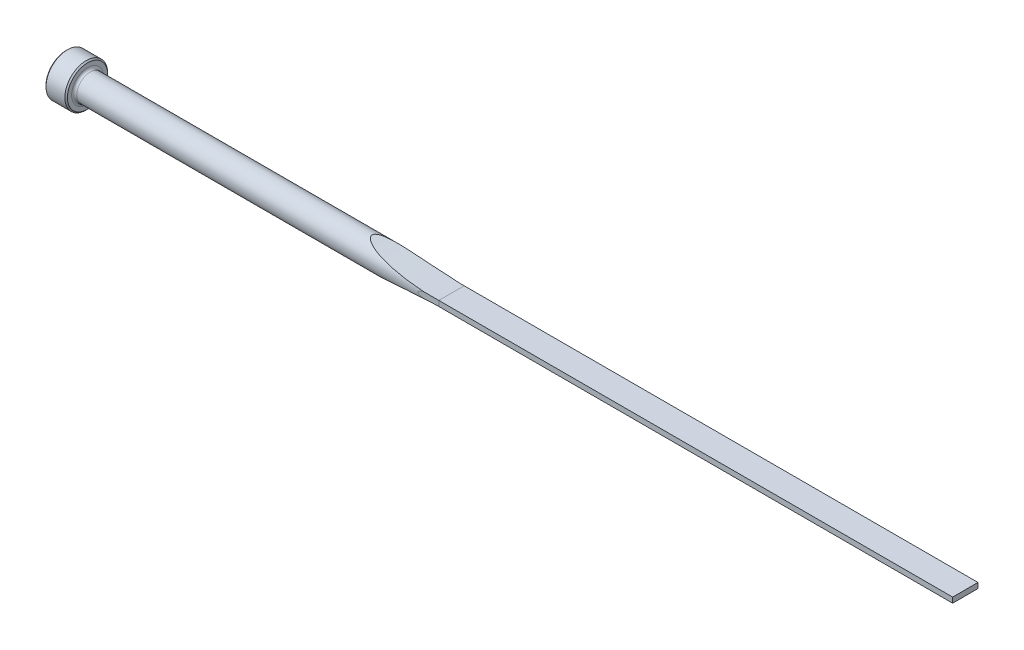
ISO-10303-21;
HEADER;
FILE_DESCRIPTION(('STEP AP214'),'2;1');
FILE_NAME('part.step','',(''),(''),'','','');
FILE_SCHEMA(('AUTOMOTIVE_DESIGN { 1 0 10303 214 1 1 1 1 }'));
ENDSEC;
DATA;
#1=APPLICATION_CONTEXT('core data for automotive mechanical design processes');
#2=APPLICATION_PROTOCOL_DEFINITION('international standard','automotive_design',2000,#1);
#3=PRODUCT_CONTEXT('',#1,'mechanical');
#4=PRODUCT('Part','Part','',(#3));
#5=PRODUCT_RELATED_PRODUCT_CATEGORY('part','',(#4));
#6=PRODUCT_DEFINITION_FORMATION('','',#4);
#7=PRODUCT_DEFINITION_CONTEXT('part definition',#1,'design');
#8=PRODUCT_DEFINITION('design','',#6,#7);
#9=PRODUCT_DEFINITION_SHAPE('','',#8);
#10=(LENGTH_UNIT() NAMED_UNIT(*) SI_UNIT(.MILLI.,.METRE.));
#11=(NAMED_UNIT(*) PLANE_ANGLE_UNIT() SI_UNIT($,.RADIAN.));
#12=(NAMED_UNIT(*) SI_UNIT($,.STERADIAN.) SOLID_ANGLE_UNIT());
#13=UNCERTAINTY_MEASURE_WITH_UNIT(LENGTH_MEASURE(1.E-05),#10,'distance_accuracy_value','');
#14=(GEOMETRIC_REPRESENTATION_CONTEXT(3) GLOBAL_UNCERTAINTY_ASSIGNED_CONTEXT((#13)) GLOBAL_UNIT_ASSIGNED_CONTEXT((#10,
#11,#12)) REPRESENTATION_CONTEXT('',''));
#15=CARTESIAN_POINT('',(0.,0.,0.));
#16=DIRECTION('',(0.,0.,1.));
#17=DIRECTION('',(1.,0.,0.));
#18=AXIS2_PLACEMENT_3D('',#15,#16,#17);
#19=CARTESIAN_POINT('',(0.,0.,0.));
#20=DIRECTION('',(-1.,0.,0.));
#21=DIRECTION('',(0.,0.,1.));
#22=AXIS2_PLACEMENT_3D('',#19,#20,#21);
#23=CYLINDRICAL_SURFACE('',#22,3.9624);
#24=CARTESIAN_POINT('',(7.112,0.,0.));
#25=DIRECTION('',(-1.,0.,0.));
#26=DIRECTION('',(0.,0.,1.));
#27=AXIS2_PLACEMENT_3D('',#24,#25,#26);
#28=CIRCLE('',#27,3.9624);
#29=CARTESIAN_POINT('',(7.112,0.,3.9624));
#30=VERTEX_POINT('',#29);
#31=EDGE_CURVE('E153',#30,#30,#28,.F.);
#32=ORIENTED_EDGE('',*,*,#31,.T.);
#33=EDGE_LOOP('',(#32));
#34=FACE_BOUND('',#33,.T.);
#35=CARTESIAN_POINT('',(114.3,1.25260892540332,3.75919999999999));
#36=CARTESIAN_POINT('',(114.00545970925,1.2524848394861,3.75919752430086));
#37=CARTESIAN_POINT('',(113.710891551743,1.24820563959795,3.76066368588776));
#38=CARTESIAN_POINT('',(113.12172376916,1.23049372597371,3.76652069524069));
#39=CARTESIAN_POINT('',(112.82712449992,1.21705045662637,3.77091491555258));
#40=CARTESIAN_POINT('',(112.230839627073,1.17967714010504,3.7827696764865));
#41=CARTESIAN_POINT('',(111.929172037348,1.15547987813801,3.79030802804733));
#42=CARTESIAN_POINT('',(111.327291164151,1.09440743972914,3.80840647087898));
#43=CARTESIAN_POINT('',(111.027077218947,1.05753871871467,3.81896502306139));
#44=CARTESIAN_POINT('',(110.580036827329,0.989457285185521,3.83693978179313));
#45=CARTESIAN_POINT('',(110.432172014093,0.964761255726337,3.84325719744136));
#46=CARTESIAN_POINT('',(110.137409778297,0.91004500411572,3.85658413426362));
#47=CARTESIAN_POINT('',(109.990512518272,0.880023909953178,3.86359376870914));
#48=CARTESIAN_POINT('',(109.69914126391,0.813153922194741,3.87821506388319));
#49=CARTESIAN_POINT('',(109.554658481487,0.776342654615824,3.88582328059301));
#50=CARTESIAN_POINT('',(109.268323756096,0.692871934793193,3.90159372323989));
#51=CARTESIAN_POINT('',(109.126472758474,0.646209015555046,3.90975614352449));
#52=CARTESIAN_POINT('',(108.918440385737,0.563595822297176,3.92220822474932));
#53=CARTESIAN_POINT('',(108.849788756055,0.533901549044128,3.92640002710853));
#54=CARTESIAN_POINT('',(108.715496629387,0.468472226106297,3.93475139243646));
#55=CARTESIAN_POINT('',(108.649847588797,0.432755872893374,3.93891101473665));
#56=CARTESIAN_POINT('',(108.560965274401,0.375177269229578,3.94463417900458));
#57=CARTESIAN_POINT('',(108.535194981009,0.357278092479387,3.94630548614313));
#58=CARTESIAN_POINT('',(108.485209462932,0.319212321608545,3.94956785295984));
#59=CARTESIAN_POINT('',(108.460999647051,0.299038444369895,3.95115862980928));
#60=CARTESIAN_POINT('',(108.414808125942,0.255565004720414,3.95421108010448));
#61=CARTESIAN_POINT('',(108.392865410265,0.23222299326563,3.9556704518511));
#62=CARTESIAN_POINT('',(108.353536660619,0.181966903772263,3.95829832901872));
#63=CARTESIAN_POINT('',(108.336121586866,0.155077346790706,3.95946868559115));
#64=CARTESIAN_POINT('',(108.315579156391,0.111677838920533,3.96085301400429));
#65=CARTESIAN_POINT('',(108.30962955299,0.0965229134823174,3.9612547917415));
#66=CARTESIAN_POINT('',(108.300234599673,0.0654488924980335,3.96188979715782));
#67=CARTESIAN_POINT('',(108.296786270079,0.0495307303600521,3.96212322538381));
#68=CARTESIAN_POINT('',(108.292762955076,0.0172237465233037,3.96239561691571));
#69=CARTESIAN_POINT('',(108.292205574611,0.00083265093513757,3.96243338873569));
#70=CARTESIAN_POINT('',(108.294083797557,-0.0317780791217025,3.9623061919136));
#71=CARTESIAN_POINT('',(108.296521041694,-0.0479976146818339,3.96214111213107));
#72=CARTESIAN_POINT('',(108.304634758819,-0.082037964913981,3.96159228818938));
#73=CARTESIAN_POINT('',(108.310722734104,-0.0997583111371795,3.96118077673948));
#74=CARTESIAN_POINT('',(108.325684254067,-0.13396962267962,3.96017177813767));
#75=CARTESIAN_POINT('',(108.334563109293,-0.15045816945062,3.959573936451));
#76=CARTESIAN_POINT('',(108.360406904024,-0.191779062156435,3.9578387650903));
#77=CARTESIAN_POINT('',(108.379002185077,-0.215572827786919,3.95659469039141));
#78=CARTESIAN_POINT('',(108.419379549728,-0.260234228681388,3.95390862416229));
#79=CARTESIAN_POINT('',(108.441170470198,-0.281093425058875,3.95246608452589));
#80=CARTESIAN_POINT('',(108.495492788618,-0.32804506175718,3.9488923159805));
#81=CARTESIAN_POINT('',(108.528933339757,-0.353067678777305,3.94670948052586));
#82=CARTESIAN_POINT('',(108.59803338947,-0.399868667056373,3.94224113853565));
#83=CARTESIAN_POINT('',(108.633697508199,-0.421639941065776,3.93995542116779));
#84=CARTESIAN_POINT('',(108.743097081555,-0.483498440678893,3.93301358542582));
#85=CARTESIAN_POINT('',(108.818906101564,-0.519877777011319,3.92829485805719));
#86=CARTESIAN_POINT('',(108.968751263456,-0.584557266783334,3.91916875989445));
#87=CARTESIAN_POINT('',(109.042649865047,-0.613195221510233,3.91475872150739));
#88=CARTESIAN_POINT('',(109.191901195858,-0.666460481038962,3.90604279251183));
#89=CARTESIAN_POINT('',(109.267254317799,-0.691086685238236,3.90173693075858));
#90=CARTESIAN_POINT('',(109.495036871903,-0.760533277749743,3.8890165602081));
#91=CARTESIAN_POINT('',(109.648854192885,-0.800789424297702,3.88081976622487));
#92=CARTESIAN_POINT('',(109.958806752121,-0.873378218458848,3.86512223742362));
#93=CARTESIAN_POINT('',(110.11494772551,-0.90568574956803,3.85762375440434));
#94=CARTESIAN_POINT('',(110.428180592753,-0.964193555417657,3.84341555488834));
#95=CARTESIAN_POINT('',(110.585270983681,-0.990401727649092,3.83670482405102));
#96=CARTESIAN_POINT('',(111.040465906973,-1.05927541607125,3.81847637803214));
#97=CARTESIAN_POINT('',(111.33953568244,-1.09580537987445,3.80800147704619));
#98=CARTESIAN_POINT('',(111.939246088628,-1.15634236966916,3.79004336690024));
#99=CARTESIAN_POINT('',(112.23988794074,-1.18033747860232,3.78256300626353));
#100=CARTESIAN_POINT('',(112.833875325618,-1.21737987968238,3.77080747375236));
#101=CARTESIAN_POINT('',(113.127202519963,-1.23070106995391,3.76645243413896));
#102=CARTESIAN_POINT('',(113.713695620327,-1.24824774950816,3.76064980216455));
#103=CARTESIAN_POINT('',(114.006861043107,-1.25248764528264,3.7591976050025));
#104=CARTESIAN_POINT('',(114.3,-1.25260892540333,3.75919999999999));
#105=B_SPLINE_CURVE_WITH_KNOTS('',3,(#35,#36,#37,#38,#39,#40,#41,#42,#43,#44,#45,#46,#47,#48,
#49,#50,#51,#52,#53,#54,#55,#56,#57,#58,#59,#60,#61,#62,#63,#64,#65,#66,#67,#68,#69,#70,#71,#72,
#73,#74,#75,#76,#77,#78,#79,#80,#81,#82,#83,#84,#85,#86,#87,#88,#89,#90,#91,#92,#93,#94,#95,#96,
#97,#98,#99,#100,#101,#102,#103,#104),.UNSPECIFIED.,.F.,.F.,(4,2,2,2,2,2,2,2,2,2,2,2,2,2,2,2,2,
2,2,2,2,2,2,2,2,2,2,2,2,2,2,2,2,2,4),(0.,0.883632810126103,1.76828515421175,2.67626818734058,
3.58378933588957,4.03386031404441,4.4840050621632,4.93172655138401,5.37960586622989,
5.60421216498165,5.82813356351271,5.92231486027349,6.01680676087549,6.11271989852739,
6.20800177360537,6.25668605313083,6.30531224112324,6.35423420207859,6.40318297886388,
6.45909548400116,6.51511503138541,6.60527273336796,6.69568462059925,6.82084462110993,
6.94627395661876,7.19837774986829,7.43639814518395,7.6744837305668,8.15173410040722,
8.63047368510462,9.10858990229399,10.0125950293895,10.9174580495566,11.7982831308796,
12.6777098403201),.UNSPECIFIED.);
#106=CARTESIAN_POINT('',(110.041058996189,0.889475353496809,3.86127535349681));
#107=VERTEX_POINT('',#106);
#108=CARTESIAN_POINT('',(110.041058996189,-0.889475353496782,3.86127535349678));
#109=VERTEX_POINT('',#108);
#110=EDGE_CURVE('E156',#107,#109,#105,.T.);
#111=ORIENTED_EDGE('',*,*,#110,.F.);
#112=CARTESIAN_POINT('',(114.3,0.787399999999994,3.88337675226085));
#113=CARTESIAN_POINT('',(113.969379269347,0.787400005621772,3.8833724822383));
#114=CARTESIAN_POINT('',(113.638761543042,0.789244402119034,3.88300338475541));
#115=CARTESIAN_POINT('',(112.977568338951,0.796621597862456,3.88149814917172));
#116=CARTESIAN_POINT('',(112.646992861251,0.802154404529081,3.88036200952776));
#117=CARTESIAN_POINT('',(111.655354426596,0.824285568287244,3.87574680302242));
#118=CARTESIAN_POINT('',(110.994411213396,0.846416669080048,3.87106094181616));
#119=CARTESIAN_POINT('',(109.673083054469,0.905424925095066,3.85768449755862));
#120=CARTESIAN_POINT('',(109.012698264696,0.942305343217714,3.84899302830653));
#121=CARTESIAN_POINT('',(107.693021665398,1.03078637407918,3.82625055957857));
#122=CARTESIAN_POINT('',(107.033729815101,1.08238642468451,3.81219976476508));
#123=CARTESIAN_POINT('',(105.918398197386,1.18220746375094,3.78216924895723));
#124=CARTESIAN_POINT('',(105.461963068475,1.22662148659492,3.76809892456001));
#125=CARTESIAN_POINT('',(104.54998563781,1.32248934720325,3.73553279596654));
#126=CARTESIAN_POINT('',(104.09444333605,1.37394318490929,3.71703699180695));
#127=CARTESIAN_POINT('',(103.184443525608,1.48386008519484,3.67454034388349));
#128=CARTESIAN_POINT('',(102.729986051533,1.54232336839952,3.65053932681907));
#129=CARTESIAN_POINT('',(101.822438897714,1.66620819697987,3.59568591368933));
#130=CARTESIAN_POINT('',(101.369349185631,1.73162957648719,3.56483368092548));
#131=CARTESIAN_POINT('',(100.464193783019,1.86946141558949,3.49452880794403));
#132=CARTESIAN_POINT('',(100.012130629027,1.94188215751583,3.45506340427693));
#133=CARTESIAN_POINT('',(99.1102314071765,2.09350738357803,3.36535346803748));
#134=CARTESIAN_POINT('',(98.6603952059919,2.1727114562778,3.3151095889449));
#135=CARTESIAN_POINT('',(97.7633080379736,2.33778135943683,3.20086383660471));
#136=CARTESIAN_POINT('',(97.3160591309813,2.42365187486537,3.13685223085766));
#137=CARTESIAN_POINT('',(96.6483923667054,2.55713953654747,3.02736328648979));
#138=CARTESIAN_POINT('',(96.4263945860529,2.60241068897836,2.98862653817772));
#139=CARTESIAN_POINT('',(95.9836897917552,2.69444697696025,2.90592636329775));
#140=CARTESIAN_POINT('',(95.7629827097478,2.74121203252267,2.86196321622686));
#141=CARTESIAN_POINT('',(95.3226484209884,2.83625735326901,2.76780501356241));
#142=CARTESIAN_POINT('',(95.1030250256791,2.88454095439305,2.71759540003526));
#143=CARTESIAN_POINT('',(94.6658149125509,2.98238888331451,2.60984200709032));
#144=CARTESIAN_POINT('',(94.4482285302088,3.03195341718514,2.55229704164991));
#145=CARTESIAN_POINT('',(94.0164200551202,3.13201098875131,2.42846573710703));
#146=CARTESIAN_POINT('',(93.8021904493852,3.18250114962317,2.36220348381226));
#147=CARTESIAN_POINT('',(93.3776644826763,3.28419729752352,2.21865519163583));
#148=CARTESIAN_POINT('',(93.1673664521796,3.33540296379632,2.14137395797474));
#149=CARTESIAN_POINT('',(92.7913165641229,3.42839026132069,1.98826340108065));
#150=CARTESIAN_POINT('',(92.6245782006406,3.47014650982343,1.91485673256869));
#151=CARTESIAN_POINT('',(92.296165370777,3.55337685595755,1.75564392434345));
#152=CARTESIAN_POINT('',(92.1345093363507,3.59484957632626,1.66979784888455));
#153=CARTESIAN_POINT('',(91.8980542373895,3.65618699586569,1.52825559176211));
#154=CARTESIAN_POINT('',(91.8197845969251,3.67660870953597,1.47860504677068));
#155=CARTESIAN_POINT('',(91.666451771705,3.71683087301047,1.37437693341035));
#156=CARTESIAN_POINT('',(91.591387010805,3.7366316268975,1.31980182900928));
#157=CARTESIAN_POINT('',(91.4459337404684,3.77519312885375,1.20506330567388));
#158=CARTESIAN_POINT('',(91.3755245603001,3.79395840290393,1.14492789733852));
#159=CARTESIAN_POINT('',(91.2408444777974,3.8300171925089,1.01781369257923));
#160=CARTESIAN_POINT('',(91.1765637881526,3.84731304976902,0.950846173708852));
#161=CARTESIAN_POINT('',(91.0702529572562,3.87603024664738,0.824736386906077));
#162=CARTESIAN_POINT('',(91.026462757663,3.88790000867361,0.767197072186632));
#163=CARTESIAN_POINT('',(90.9461270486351,3.90973187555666,0.64680152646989));
#164=CARTESIAN_POINT('',(90.909583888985,3.91969336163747,0.583943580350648));
#165=CARTESIAN_POINT('',(90.8459164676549,3.9370817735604,0.452174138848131));
#166=CARTESIAN_POINT('',(90.8189160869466,3.94447534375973,0.383196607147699));
#167=CARTESIAN_POINT('',(90.7780102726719,3.95568784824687,0.241204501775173));
#168=CARTESIAN_POINT('',(90.7640756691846,3.95951474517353,0.168199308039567));
#169=CARTESIAN_POINT('',(90.75186202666,3.9628688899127,0.0276036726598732));
#170=CARTESIAN_POINT('',(90.7522506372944,3.962762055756,-0.0398608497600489));
#171=CARTESIAN_POINT('',(90.7653488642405,3.95916522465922,-0.173500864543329));
#172=CARTESIAN_POINT('',(90.7780681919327,3.95567256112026,-0.239675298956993));
#173=CARTESIAN_POINT('',(90.8165826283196,3.94511439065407,-0.376839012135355));
#174=CARTESIAN_POINT('',(90.8438257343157,3.93765350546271,-0.447381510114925));
#175=CARTESIAN_POINT('',(90.9089002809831,3.91987937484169,-0.582973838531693));
#176=CARTESIAN_POINT('',(90.9467503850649,3.90956110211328,-0.648013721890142));
#177=CARTESIAN_POINT('',(91.0560500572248,3.87986173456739,-0.811067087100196));
#178=CARTESIAN_POINT('',(91.1337788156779,3.85882884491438,-0.904512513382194));
#179=CARTESIAN_POINT('',(91.3013669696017,3.8137689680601,-1.07884269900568));
#180=CARTESIAN_POINT('',(91.3912602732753,3.789733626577,-1.15969093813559));
#181=CARTESIAN_POINT('',(91.6088802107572,3.7319495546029,-1.33578715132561));
#182=CARTESIAN_POINT('',(91.7394534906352,3.69756955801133,-1.42726069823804));
#183=CARTESIAN_POINT('',(92.0085826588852,3.62740818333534,-1.59716585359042));
#184=CARTESIAN_POINT('',(92.1471538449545,3.59162416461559,-1.67557127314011));
#185=CARTESIAN_POINT('',(92.4301031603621,3.51931398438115,-1.8225730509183));
#186=CARTESIAN_POINT('',(92.5745073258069,3.48278496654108,-1.89111728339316));
#187=CARTESIAN_POINT('',(92.8667172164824,3.40966781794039,-2.01996308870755));
#188=CARTESIAN_POINT('',(93.0145196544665,3.37307977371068,-2.08027226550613));
#189=CARTESIAN_POINT('',(93.2916680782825,3.30524107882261,-2.18617581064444));
#190=CARTESIAN_POINT('',(93.420676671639,3.27396553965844,-2.23264583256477));
#191=CARTESIAN_POINT('',(93.6802039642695,3.21167027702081,-2.32136153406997));
#192=CARTESIAN_POINT('',(93.8107227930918,3.18065057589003,-2.36360684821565));
#193=CARTESIAN_POINT('',(94.2042032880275,3.08808399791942,-2.4849041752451));
#194=CARTESIAN_POINT('',(94.4689796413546,3.02705643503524,-2.5584770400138));
#195=CARTESIAN_POINT('',(95.0023238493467,2.90673022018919,-2.69439177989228));
#196=CARTESIAN_POINT('',(95.2708983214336,2.84743533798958,-2.75671050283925));
#197=CARTESIAN_POINT('',(95.8104857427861,2.73095083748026,-2.87214930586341));
#198=CARTESIAN_POINT('',(96.0814989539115,2.67376144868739,-2.9252683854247));
#199=CARTESIAN_POINT('',(96.6258098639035,2.56156938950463,-3.02399762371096));
#200=CARTESIAN_POINT('',(96.8991106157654,2.50657051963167,-3.069595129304));
#201=CARTESIAN_POINT('',(97.4471765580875,2.39896812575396,-3.15440243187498));
#202=CARTESIAN_POINT('',(97.7219418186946,2.34636471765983,-3.19361191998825));
#203=CARTESIAN_POINT('',(98.2723044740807,2.24369674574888,-3.26655764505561));
#204=CARTESIAN_POINT('',(98.5479004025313,2.19362909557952,-3.3003006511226));
#205=CARTESIAN_POINT('',(99.1000682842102,2.09601517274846,-3.36313743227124));
#206=CARTESIAN_POINT('',(99.3766402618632,2.04846896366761,-3.39223109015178));
#207=CARTESIAN_POINT('',(100.22528730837,1.90671704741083,-3.47524875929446));
#208=CARTESIAN_POINT('',(100.798704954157,1.81668630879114,-3.52265966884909));
#209=CARTESIAN_POINT('',(101.948100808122,1.64776053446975,-3.60475663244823));
#210=CARTESIAN_POINT('',(102.524079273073,1.5688666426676,-3.63944137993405));
#211=CARTESIAN_POINT('',(103.678386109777,1.4222877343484,-3.69918591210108));
#212=CARTESIAN_POINT('',(104.256715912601,1.35461111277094,-3.72423850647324));
#213=CARTESIAN_POINT('',(105.414829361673,1.2306145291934,-3.76702730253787));
#214=CARTESIAN_POINT('',(105.99461295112,1.17429413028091,-3.78476378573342));
#215=CARTESIAN_POINT('',(107.154045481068,1.07316172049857,-3.81467022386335));
#216=CARTESIAN_POINT('',(107.733691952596,1.02832485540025,-3.82685224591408));
#217=CARTESIAN_POINT('',(108.893833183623,0.950026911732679,-3.84703720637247));
#218=CARTESIAN_POINT('',(109.474327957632,0.916566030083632,-3.85504007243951));
#219=CARTESIAN_POINT('',(110.635679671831,0.861049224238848,-3.86781814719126));
#220=CARTESIAN_POINT('',(111.216536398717,0.838989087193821,-3.872594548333));
#221=CARTESIAN_POINT('',(112.378569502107,0.806266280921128,-3.87953998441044));
#222=CARTESIAN_POINT('',(112.959745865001,0.795603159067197,-3.8817091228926));
#223=CARTESIAN_POINT('',(113.667465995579,0.789560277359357,-3.88293796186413));
#224=CARTESIAN_POINT('',(113.79397377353,0.788750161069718,-3.88310266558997));
#225=CARTESIAN_POINT('',(114.046987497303,0.787670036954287,-3.88332214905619));
#226=CARTESIAN_POINT('',(114.173493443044,0.787400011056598,-3.88337693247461));
#227=CARTESIAN_POINT('',(114.3,0.7874,-3.88337675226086));
#228=B_SPLINE_CURVE_WITH_KNOTS('',3,(#112,#113,#114,#115,#116,#117,#118,#119,#120,#121,#122,
#123,#124,#125,#126,#127,#128,#129,#130,#131,#132,#133,#134,#135,#136,#137,#138,#139,#140,#141,
#142,#143,#144,#145,#146,#147,#148,#149,#150,#151,#152,#153,#154,#155,#156,#157,#158,#159,#160,
#161,#162,#163,#164,#165,#166,#167,#168,#169,#170,#171,#172,#173,#174,#175,#176,#177,#178,#179,
#180,#181,#182,#183,#184,#185,#186,#187,#188,#189,#190,#191,#192,#193,#194,#195,#196,#197,#198,
#199,#200,#201,#202,#203,#204,#205,#206,#207,#208,#209,#210,#211,#212,#213,#214,#215,#216,#217,
#218,#219,#220,#221,#222,#223,#224,#225,#226,#227),.UNSPECIFIED.,.F.,.F.,(4,2,2,2,2,2,2,2,2,2,2,
2,2,2,2,2,2,2,2,2,2,2,2,2,2,2,2,2,2,2,2,2,2,2,2,2,2,2,2,2,2,2,2,2,2,2,2,2,2,2,2,2,2,2,2,2,2,4),
(0.,0.991850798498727,1.98370359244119,3.96750439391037,5.95174430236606,7.93590844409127,
9.31226185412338,10.6886152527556,12.0650119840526,13.4413759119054,14.8197934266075,
16.1981273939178,17.5774389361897,18.2669484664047,18.9564211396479,19.6475318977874,
20.3387545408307,21.0281059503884,21.7171576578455,22.2775648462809,22.8398127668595,
23.1244115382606,23.4088686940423,23.6919637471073,23.9745988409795,24.1939791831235,
24.413430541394,24.6356342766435,24.8573407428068,25.0584810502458,25.2597798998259,
25.4864909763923,25.7136034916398,26.0815750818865,26.4505943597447,26.9387163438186,
27.4278050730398,27.9193909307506,28.4105197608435,28.8323721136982,29.2542609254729,
30.0983968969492,30.944250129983,31.7901952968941,32.637549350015,33.4849443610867,
34.3312818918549,35.1776407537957,36.9244292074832,38.671396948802,40.4196662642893,
42.1678683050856,43.9122540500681,45.656669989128,47.4004408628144,49.1441424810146,
49.5236733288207,49.9031914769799),.UNSPECIFIED.);
#229=CARTESIAN_POINT('',(110.041058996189,0.88947535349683,-3.8612753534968));
#230=VERTEX_POINT('',#229);
#231=EDGE_CURVE('E106',#107,#230,#228,.T.);
#232=ORIENTED_EDGE('',*,*,#231,.T.);
#233=CARTESIAN_POINT('',(114.3,1.25260892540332,-3.75919999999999));
#234=CARTESIAN_POINT('',(114.00545970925,1.2524848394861,-3.75919752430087));
#235=CARTESIAN_POINT('',(113.710891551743,1.24820563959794,-3.76066368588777));
#236=CARTESIAN_POINT('',(113.12172376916,1.23049372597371,-3.76652069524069));
#237=CARTESIAN_POINT('',(112.827124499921,1.21705045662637,-3.77091491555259));
#238=CARTESIAN_POINT('',(112.230839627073,1.17967714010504,-3.78276967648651));
#239=CARTESIAN_POINT('',(111.929172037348,1.15547987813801,-3.79030802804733));
#240=CARTESIAN_POINT('',(111.327291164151,1.09440743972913,-3.80840647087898));
#241=CARTESIAN_POINT('',(111.027077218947,1.05753871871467,-3.81896502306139));
#242=CARTESIAN_POINT('',(110.580036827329,0.98945728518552,-3.83693978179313));
#243=CARTESIAN_POINT('',(110.432172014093,0.964761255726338,-3.84325719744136));
#244=CARTESIAN_POINT('',(110.137409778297,0.910045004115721,-3.85658413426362));
#245=CARTESIAN_POINT('',(109.990512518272,0.880023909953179,-3.86359376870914));
#246=CARTESIAN_POINT('',(109.69914126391,0.813153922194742,-3.87821506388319));
#247=CARTESIAN_POINT('',(109.554658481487,0.776342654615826,-3.88582328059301));
#248=CARTESIAN_POINT('',(109.268323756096,0.692871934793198,-3.90159372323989));
#249=CARTESIAN_POINT('',(109.126472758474,0.646209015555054,-3.90975614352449));
#250=CARTESIAN_POINT('',(108.918440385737,0.56359582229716,-3.92220822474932));
#251=CARTESIAN_POINT('',(108.849788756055,0.533901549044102,-3.92640002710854));
#252=CARTESIAN_POINT('',(108.715496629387,0.468472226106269,-3.93475139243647));
#253=CARTESIAN_POINT('',(108.649847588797,0.432755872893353,-3.93891101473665));
#254=CARTESIAN_POINT('',(108.560965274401,0.37517726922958,-3.94463417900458));
#255=CARTESIAN_POINT('',(108.535194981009,0.357278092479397,-3.94630548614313));
#256=CARTESIAN_POINT('',(108.485209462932,0.319212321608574,-3.94956785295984));
#257=CARTESIAN_POINT('',(108.460999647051,0.299038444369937,-3.95115862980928));
#258=CARTESIAN_POINT('',(108.414808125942,0.25556500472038,-3.95421108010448));
#259=CARTESIAN_POINT('',(108.392865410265,0.232222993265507,-3.95567045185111));
#260=CARTESIAN_POINT('',(108.353536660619,0.181966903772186,-3.95829832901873));
#261=CARTESIAN_POINT('',(108.336121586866,0.15507734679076,-3.95946868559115));
#262=CARTESIAN_POINT('',(108.315579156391,0.111677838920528,-3.96085301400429));
#263=CARTESIAN_POINT('',(108.30962955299,0.0965229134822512,-3.9612547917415));
#264=CARTESIAN_POINT('',(108.300234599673,0.0654488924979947,-3.96188979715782));
#265=CARTESIAN_POINT('',(108.296786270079,0.0495307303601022,-3.96212322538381));
#266=CARTESIAN_POINT('',(108.292762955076,0.0172237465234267,-3.9623956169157));
#267=CARTESIAN_POINT('',(108.292205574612,0.000832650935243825,-3.96243338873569));
#268=CARTESIAN_POINT('',(108.294083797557,-0.0317780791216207,-3.9623061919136));
#269=CARTESIAN_POINT('',(108.296521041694,-0.0479976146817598,-3.96214111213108));
#270=CARTESIAN_POINT('',(108.304634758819,-0.0820379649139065,-3.96159228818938));
#271=CARTESIAN_POINT('',(108.310722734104,-0.0997583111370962,-3.96118077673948));
#272=CARTESIAN_POINT('',(108.325684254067,-0.133969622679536,-3.96017177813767));
#273=CARTESIAN_POINT('',(108.334563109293,-0.150458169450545,-3.959573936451));
#274=CARTESIAN_POINT('',(108.360406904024,-0.191779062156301,-3.9578387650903));
#275=CARTESIAN_POINT('',(108.379002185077,-0.215572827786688,-3.95659469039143));
#276=CARTESIAN_POINT('',(108.419379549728,-0.260234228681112,-3.9539086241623));
#277=CARTESIAN_POINT('',(108.441170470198,-0.281093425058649,-3.9524660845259));
#278=CARTESIAN_POINT('',(108.495492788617,-0.328045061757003,-3.94889231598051));
#279=CARTESIAN_POINT('',(108.528933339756,-0.353067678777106,-3.94670948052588));
#280=CARTESIAN_POINT('',(108.59803338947,-0.399868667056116,-3.94224113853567));
#281=CARTESIAN_POINT('',(108.633697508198,-0.421639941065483,-3.93995542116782));
#282=CARTESIAN_POINT('',(108.743097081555,-0.483498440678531,-3.93301358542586));
#283=CARTESIAN_POINT('',(108.818906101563,-0.519877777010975,-3.92829485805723));
#284=CARTESIAN_POINT('',(108.968751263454,-0.584557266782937,-3.91916875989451));
#285=CARTESIAN_POINT('',(109.042649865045,-0.613195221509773,-3.91475872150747));
#286=CARTESIAN_POINT('',(109.191901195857,-0.666460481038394,-3.90604279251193));
#287=CARTESIAN_POINT('',(109.267254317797,-0.691086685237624,-3.90173693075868));
#288=CARTESIAN_POINT('',(109.495036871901,-0.760533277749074,-3.88901656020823));
#289=CARTESIAN_POINT('',(109.648854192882,-0.800789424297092,-3.88081976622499));
#290=CARTESIAN_POINT('',(109.958806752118,-0.873378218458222,-3.86512223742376));
#291=CARTESIAN_POINT('',(110.114947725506,-0.905685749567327,-3.8576237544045));
#292=CARTESIAN_POINT('',(110.42818059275,-0.964193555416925,-3.84341555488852));
#293=CARTESIAN_POINT('',(110.585270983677,-0.990401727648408,-3.8367048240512));
#294=CARTESIAN_POINT('',(111.040465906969,-1.05927541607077,-3.81847637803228));
#295=CARTESIAN_POINT('',(111.339535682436,-1.09580537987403,-3.80800147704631));
#296=CARTESIAN_POINT('',(111.939246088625,-1.1563423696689,-3.79004336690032));
#297=CARTESIAN_POINT('',(112.239887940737,-1.18033747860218,-3.78256300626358));
#298=CARTESIAN_POINT('',(112.833875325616,-1.21737987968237,-3.77080747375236));
#299=CARTESIAN_POINT('',(113.127202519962,-1.23070106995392,-3.76645243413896));
#300=CARTESIAN_POINT('',(113.713695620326,-1.24824774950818,-3.76064980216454));
#301=CARTESIAN_POINT('',(114.006861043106,-1.25248764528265,-3.7591976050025));
#302=CARTESIAN_POINT('',(114.3,-1.25260892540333,-3.75919999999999));
#303=B_SPLINE_CURVE_WITH_KNOTS('',3,(#233,#234,#235,#236,#237,#238,#239,#240,#241,#242,#243,
#244,#245,#246,#247,#248,#249,#250,#251,#252,#253,#254,#255,#256,#257,#258,#259,#260,#261,#262,
#263,#264,#265,#266,#267,#268,#269,#270,#271,#272,#273,#274,#275,#276,#277,#278,#279,#280,#281,
#282,#283,#284,#285,#286,#287,#288,#289,#290,#291,#292,#293,#294,#295,#296,#297,#298,#299,#300,
#301,#302),.UNSPECIFIED.,.F.,.F.,(4,2,2,2,2,2,2,2,2,2,2,2,2,2,2,2,2,2,2,2,2,2,2,2,2,2,2,2,2,2,2,
2,2,2,4),(0.,0.883632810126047,1.76828515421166,2.67626818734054,3.58378933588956,
4.03386031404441,4.48400506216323,4.93172655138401,5.37960586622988,5.60421216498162,
5.82813356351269,5.92231486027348,6.01680676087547,6.11271989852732,6.20800177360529,
6.25668605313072,6.30531224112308,6.35423420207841,6.40318297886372,6.459095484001,
6.51511503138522,6.60527273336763,6.69568462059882,6.82084462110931,6.94627395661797,
7.1983777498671,7.4363981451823,7.6744837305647,8.15173410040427,8.63047368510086,
9.10858990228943,10.0125950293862,10.9174580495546,11.7982831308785,12.67770984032),.UNSPECIFIED.);
#304=CARTESIAN_POINT('',(110.041058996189,-0.889475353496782,-3.86127535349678));
#305=VERTEX_POINT('',#304);
#306=EDGE_CURVE('E175',#230,#305,#303,.T.);
#307=ORIENTED_EDGE('',*,*,#306,.T.);
#308=CARTESIAN_POINT('',(114.3,-0.787399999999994,3.88337675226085));
#309=CARTESIAN_POINT('',(113.969379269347,-0.787400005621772,3.8833724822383));
#310=CARTESIAN_POINT('',(113.638761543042,-0.789244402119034,3.88300338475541));
#311=CARTESIAN_POINT('',(112.977568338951,-0.796621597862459,3.88149814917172));
#312=CARTESIAN_POINT('',(112.646992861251,-0.802154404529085,3.88036200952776));
#313=CARTESIAN_POINT('',(111.655354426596,-0.824285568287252,3.87574680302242));
#314=CARTESIAN_POINT('',(110.994411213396,-0.846416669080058,3.87106094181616));
#315=CARTESIAN_POINT('',(109.673083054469,-0.905424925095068,3.85768449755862));
#316=CARTESIAN_POINT('',(109.012698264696,-0.942305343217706,3.84899302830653));
#317=CARTESIAN_POINT('',(107.693021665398,-1.03078637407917,3.82625055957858));
#318=CARTESIAN_POINT('',(107.033729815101,-1.0823864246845,3.81219976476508));
#319=CARTESIAN_POINT('',(105.918398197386,-1.18220746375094,3.78216924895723));
#320=CARTESIAN_POINT('',(105.461963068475,-1.22662148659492,3.76809892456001));
#321=CARTESIAN_POINT('',(104.54998563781,-1.32248934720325,3.73553279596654));
#322=CARTESIAN_POINT('',(104.09444333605,-1.3739431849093,3.71703699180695));
#323=CARTESIAN_POINT('',(103.184443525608,-1.48386008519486,3.67454034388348));
#324=CARTESIAN_POINT('',(102.729986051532,-1.54232336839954,3.65053932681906));
#325=CARTESIAN_POINT('',(101.822438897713,-1.66620819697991,3.59568591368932));
#326=CARTESIAN_POINT('',(101.36934918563,-1.73162957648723,3.56483368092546));
#327=CARTESIAN_POINT('',(100.464193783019,-1.86946141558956,3.494528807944));
#328=CARTESIAN_POINT('',(100.012130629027,-1.9418821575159,3.45506340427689));
#329=CARTESIAN_POINT('',(99.1102314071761,-2.0935073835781,3.36535346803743));
#330=CARTESIAN_POINT('',(98.6603952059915,-2.17271145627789,3.31510958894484));
#331=CARTESIAN_POINT('',(97.7633080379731,-2.33778135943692,3.20086383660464));
#332=CARTESIAN_POINT('',(97.3160591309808,-2.42365187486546,3.1368522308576));
#333=CARTESIAN_POINT('',(96.6483923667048,-2.55713953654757,3.0273632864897));
#334=CARTESIAN_POINT('',(96.4263945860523,-2.60241068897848,2.98862653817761));
#335=CARTESIAN_POINT('',(95.9836897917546,-2.69444697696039,2.90592636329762));
#336=CARTESIAN_POINT('',(95.7629827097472,-2.7412120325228,2.86196321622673));
#337=CARTESIAN_POINT('',(95.3226484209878,-2.83625735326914,2.76780501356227));
#338=CARTESIAN_POINT('',(95.1030250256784,-2.88454095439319,2.71759540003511));
#339=CARTESIAN_POINT('',(94.6658149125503,-2.98238888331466,2.60984200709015));
#340=CARTESIAN_POINT('',(94.4482285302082,-3.03195341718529,2.55229704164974));
#341=CARTESIAN_POINT('',(94.0164200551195,-3.13201098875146,2.42846573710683));
#342=CARTESIAN_POINT('',(93.8021904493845,-3.18250114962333,2.36220348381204));
#343=CARTESIAN_POINT('',(93.3776644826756,-3.28419729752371,2.21865519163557));
#344=CARTESIAN_POINT('',(93.1673664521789,-3.33540296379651,2.14137395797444));
#345=CARTESIAN_POINT('',(92.7913165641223,-3.42839026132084,1.98826340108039));
#346=CARTESIAN_POINT('',(92.6245782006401,-3.47014650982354,1.9148567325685));
#347=CARTESIAN_POINT('',(92.2961653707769,-3.55337685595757,1.75564392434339));
#348=CARTESIAN_POINT('',(92.1345093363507,-3.59484957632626,1.66979784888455));
#349=CARTESIAN_POINT('',(91.8980542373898,-3.65618699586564,1.52825559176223));
#350=CARTESIAN_POINT('',(91.8197845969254,-3.6766087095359,1.47860504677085));
#351=CARTESIAN_POINT('',(91.6664517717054,-3.71683087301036,1.37437693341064));
#352=CARTESIAN_POINT('',(91.5913870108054,-3.73663162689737,1.31980182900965));
#353=CARTESIAN_POINT('',(91.445933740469,-3.77519312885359,1.20506330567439));
#354=CARTESIAN_POINT('',(91.3755245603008,-3.79395840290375,1.14492789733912));
#355=CARTESIAN_POINT('',(91.2408444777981,-3.8300171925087,1.01781369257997));
#356=CARTESIAN_POINT('',(91.1765637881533,-3.84731304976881,0.950846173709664));
#357=CARTESIAN_POINT('',(91.070252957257,-3.87603024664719,0.824736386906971));
#358=CARTESIAN_POINT('',(91.0264627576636,-3.88790000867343,0.767197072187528));
#359=CARTESIAN_POINT('',(90.9461270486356,-3.90973187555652,0.646801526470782));
#360=CARTESIAN_POINT('',(90.9095838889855,-3.91969336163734,0.583943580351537));
#361=CARTESIAN_POINT('',(90.8459164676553,-3.9370817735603,0.452174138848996));
#362=CARTESIAN_POINT('',(90.8189160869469,-3.94447534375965,0.383196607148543));
#363=CARTESIAN_POINT('',(90.7780102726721,-3.95568784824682,0.241204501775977));
#364=CARTESIAN_POINT('',(90.7640756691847,-3.9595147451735,0.168199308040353));
#365=CARTESIAN_POINT('',(90.75186202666,-3.9628688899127,0.0276036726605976));
#366=CARTESIAN_POINT('',(90.7522506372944,-3.96276205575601,-0.0398608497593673));
#367=CARTESIAN_POINT('',(90.7653488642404,-3.95916522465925,-0.173500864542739));
#368=CARTESIAN_POINT('',(90.7780681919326,-3.95567256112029,-0.239675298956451));
#369=CARTESIAN_POINT('',(90.8165826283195,-3.94511439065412,-0.37683901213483));
#370=CARTESIAN_POINT('',(90.8438257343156,-3.93765350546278,-0.447381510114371));
#371=CARTESIAN_POINT('',(90.9089002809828,-3.91987937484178,-0.582973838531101));
#372=CARTESIAN_POINT('',(90.9467503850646,-3.90956110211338,-0.648013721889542));
#373=CARTESIAN_POINT('',(91.0560500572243,-3.87986173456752,-0.811067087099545));
#374=CARTESIAN_POINT('',(91.1337788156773,-3.85882884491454,-0.904512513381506));
#375=CARTESIAN_POINT('',(91.3013669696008,-3.81376896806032,-1.07884269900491));
#376=CARTESIAN_POINT('',(91.3912602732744,-3.78973362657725,-1.15969093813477));
#377=CARTESIAN_POINT('',(91.6088802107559,-3.73194955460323,-1.33578715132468));
#378=CARTESIAN_POINT('',(91.7394534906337,-3.6975695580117,-1.42726069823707));
#379=CARTESIAN_POINT('',(92.0085826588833,-3.62740818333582,-1.59716585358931));
#380=CARTESIAN_POINT('',(92.1471538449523,-3.59162416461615,-1.67557127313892));
#381=CARTESIAN_POINT('',(92.4301031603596,-3.51931398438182,-1.82257305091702));
#382=CARTESIAN_POINT('',(92.5745073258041,-3.48278496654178,-1.89111728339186));
#383=CARTESIAN_POINT('',(92.8667172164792,-3.40966781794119,-2.01996308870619));
#384=CARTESIAN_POINT('',(93.0145196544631,-3.37307977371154,-2.08027226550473));
#385=CARTESIAN_POINT('',(93.2916680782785,-3.30524107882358,-2.18617581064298));
#386=CARTESIAN_POINT('',(93.4206766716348,-3.27396553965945,-2.23264583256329));
#387=CARTESIAN_POINT('',(93.6802039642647,-3.21167027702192,-2.32136153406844));
#388=CARTESIAN_POINT('',(93.8107227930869,-3.18065057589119,-2.36360684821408));
#389=CARTESIAN_POINT('',(94.2042032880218,-3.08808399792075,-2.48490417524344));
#390=CARTESIAN_POINT('',(94.4689796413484,-3.02705643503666,-2.55847704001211));
#391=CARTESIAN_POINT('',(95.0023238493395,-2.90673022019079,-2.69439177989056));
#392=CARTESIAN_POINT('',(95.2708983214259,-2.84743533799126,-2.75671050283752));
#393=CARTESIAN_POINT('',(95.8104857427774,-2.73095083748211,-2.87214930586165));
#394=CARTESIAN_POINT('',(96.0814989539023,-2.67376144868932,-2.92526838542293));
#395=CARTESIAN_POINT('',(96.6258098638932,-2.56156938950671,-3.02399762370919));
#396=CARTESIAN_POINT('',(96.8991106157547,-2.50657051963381,-3.06959512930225));
#397=CARTESIAN_POINT('',(97.4471765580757,-2.39896812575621,-3.15440243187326));
#398=CARTESIAN_POINT('',(97.7219418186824,-2.34636471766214,-3.19361191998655));
#399=CARTESIAN_POINT('',(98.2723044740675,-2.24369674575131,-3.26655764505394));
#400=CARTESIAN_POINT('',(98.5479004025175,-2.19362909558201,-3.30030065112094));
#401=CARTESIAN_POINT('',(99.1000682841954,-2.09601517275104,-3.36313743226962));
#402=CARTESIAN_POINT('',(99.376640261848,-2.04846896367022,-3.3922310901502));
#403=CARTESIAN_POINT('',(100.225287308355,-1.90671704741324,-3.47524875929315));
#404=CARTESIAN_POINT('',(100.798704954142,-1.81668630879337,-3.52265966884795));
#405=CARTESIAN_POINT('',(101.948100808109,-1.64776053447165,-3.60475663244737));
#406=CARTESIAN_POINT('',(102.52407927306,-1.56886664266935,-3.6394413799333));
#407=CARTESIAN_POINT('',(103.678386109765,-1.42228773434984,-3.69918591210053));
#408=CARTESIAN_POINT('',(104.256715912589,-1.35461111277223,-3.72423850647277));
#409=CARTESIAN_POINT('',(105.414829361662,-1.23061452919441,-3.76702730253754));
#410=CARTESIAN_POINT('',(105.99461295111,-1.17429413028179,-3.78476378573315));
#411=CARTESIAN_POINT('',(107.15404548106,-1.07316172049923,-3.81467022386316));
#412=CARTESIAN_POINT('',(107.733691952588,-1.02832485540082,-3.82685224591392));
#413=CARTESIAN_POINT('',(108.893833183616,-0.950026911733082,-3.84703720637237));
#414=CARTESIAN_POINT('',(109.474327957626,-0.916566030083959,-3.85504007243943));
#415=CARTESIAN_POINT('',(110.635679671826,-0.861049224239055,-3.86781814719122));
#416=CARTESIAN_POINT('',(111.216536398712,-0.838989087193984,-3.87259454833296));
#417=CARTESIAN_POINT('',(112.378569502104,-0.806266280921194,-3.87953998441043));
#418=CARTESIAN_POINT('',(112.959745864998,-0.795603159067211,-3.8817091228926));
#419=CARTESIAN_POINT('',(113.667465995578,-0.789560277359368,-3.88293796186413));
#420=CARTESIAN_POINT('',(113.793973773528,-0.788750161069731,-3.88310266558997));
#421=CARTESIAN_POINT('',(114.046987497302,-0.787670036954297,-3.88332214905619));
#422=CARTESIAN_POINT('',(114.173493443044,-0.787400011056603,-3.8833769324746));
#423=CARTESIAN_POINT('',(114.3,-0.78739999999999,-3.88337675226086));
#424=B_SPLINE_CURVE_WITH_KNOTS('',3,(#308,#309,#310,#311,#312,#313,#314,#315,#316,#317,#318,
#319,#320,#321,#322,#323,#324,#325,#326,#327,#328,#329,#330,#331,#332,#333,#334,#335,#336,#337,
#338,#339,#340,#341,#342,#343,#344,#345,#346,#347,#348,#349,#350,#351,#352,#353,#354,#355,#356,
#357,#358,#359,#360,#361,#362,#363,#364,#365,#366,#367,#368,#369,#370,#371,#372,#373,#374,#375,
#376,#377,#378,#379,#380,#381,#382,#383,#384,#385,#386,#387,#388,#389,#390,#391,#392,#393,#394,
#395,#396,#397,#398,#399,#400,#401,#402,#403,#404,#405,#406,#407,#408,#409,#410,#411,#412,#413,
#414,#415,#416,#417,#418,#419,#420,#421,#422,#423),.UNSPECIFIED.,.F.,.F.,(4,2,2,2,2,2,2,2,2,2,2,
2,2,2,2,2,2,2,2,2,2,2,2,2,2,2,2,2,2,2,2,2,2,2,2,2,2,2,2,2,2,2,2,2,2,2,2,2,2,2,2,2,2,2,2,2,2,4),
(0.,0.991850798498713,1.98370359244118,3.96750439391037,5.95174430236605,7.93590844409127,
9.31226185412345,10.6886152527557,12.0650119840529,13.4413759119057,14.8197934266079,
16.1981273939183,17.5774389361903,18.2669484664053,18.9564211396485,19.6475318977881,
20.3387545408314,21.0281059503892,21.7171576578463,22.2775648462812,22.8398127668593,
23.1244115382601,23.4088686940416,23.6919637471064,23.9745988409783,24.1939791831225,
24.413430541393,24.6356342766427,24.857340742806,25.0584810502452,25.2597798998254,
25.4864909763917,25.7136034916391,26.0815750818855,26.4505943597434,26.9387163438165,
27.4278050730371,27.9193909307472,28.4105197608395,28.8323721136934,29.2542609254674,
30.0983968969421,30.9442501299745,31.790195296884,32.6375493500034,33.4849443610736,
34.3312818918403,35.1776407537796,36.9244292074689,38.6713969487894,40.4196662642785,
42.1678683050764,43.9122540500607,45.6566699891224,47.4004408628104,49.1441424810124,
49.5236733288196,49.9031914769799),.UNSPECIFIED.);
#425=EDGE_CURVE('E105',#109,#305,#424,.T.);
#426=ORIENTED_EDGE('',*,*,#425,.F.);
#427=EDGE_LOOP('',(#111,#232,#307,#426));
#428=FACE_BOUND('',#427,.T.);
#429=ADVANCED_FACE('F33',(#34,#428),#23,.T.);
#430=CARTESIAN_POINT('',(266.7,3.9624,0.));
#431=DIRECTION('',(-1.,0.,0.));
#432=DIRECTION('',(0.,0.,1.));
#433=AXIS2_PLACEMENT_3D('',#430,#431,#432);
#434=PLANE('',#433);
#435=DIRECTION('',(0.,1.,0.));
#436=VECTOR('',#435,1.);
#437=CARTESIAN_POINT('',(266.7,-6.35,3.75920000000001));
#438=LINE('',#437,#436);
#439=CARTESIAN_POINT('',(266.7,-0.787400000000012,3.75920000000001));
#440=VERTEX_POINT('',#439);
#441=CARTESIAN_POINT('',(266.7,0.787400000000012,3.75920000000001));
#442=VERTEX_POINT('',#441);
#443=EDGE_CURVE('E87',#440,#442,#438,.T.);
#444=ORIENTED_EDGE('',*,*,#443,.F.);
#445=DIRECTION('',(0.,0.,1.));
#446=VECTOR('',#445,1.);
#447=CARTESIAN_POINT('',(266.7,-0.787400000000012,0.));
#448=LINE('',#447,#446);
#449=CARTESIAN_POINT('',(266.7,-0.787400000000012,-3.7592));
#450=VERTEX_POINT('',#449);
#451=EDGE_CURVE('E100',#450,#440,#448,.T.);
#452=ORIENTED_EDGE('',*,*,#451,.F.);
#453=DIRECTION('',(0.,1.,0.));
#454=VECTOR('',#453,1.);
#455=CARTESIAN_POINT('',(266.7,-6.35,-3.75920000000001));
#456=LINE('',#455,#454);
#457=CARTESIAN_POINT('',(266.7,0.787400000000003,-3.75920000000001));
#458=VERTEX_POINT('',#457);
#459=EDGE_CURVE('E56',#450,#458,#456,.T.);
#460=ORIENTED_EDGE('',*,*,#459,.T.);
#461=DIRECTION('',(0.,0.,1.));
#462=VECTOR('',#461,1.);
#463=CARTESIAN_POINT('',(266.7,0.787400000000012,0.));
#464=LINE('',#463,#462);
#465=EDGE_CURVE('E102',#458,#442,#464,.T.);
#466=ORIENTED_EDGE('',*,*,#465,.T.);
#467=EDGE_LOOP('',(#444,#452,#460,#466));
#468=FACE_BOUND('',#467,.T.);
#469=ADVANCED_FACE('F99',(#468),#434,.F.);
#470=CARTESIAN_POINT('',(114.3,89.6874,-6.35));
#471=DIRECTION('',(0.,0.,1.));
#472=DIRECTION('',(1.,0.,0.));
#473=AXIS2_PLACEMENT_3D('',#470,#471,#472);
#474=CYLINDRICAL_SURFACE('',#473,88.9);
#475=CARTESIAN_POINT('',(114.3,89.6874,92.6592));
#476=DIRECTION('',(0.,-0.707106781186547,0.707106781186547));
#477=DIRECTION('',(0.,0.707106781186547,0.707106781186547));
#478=AXIS2_PLACEMENT_3D('',#475,#476,#477);
#479=ELLIPSE('',#478,125.723585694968,88.9);
#480=CARTESIAN_POINT('',(114.3,0.787400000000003,3.75919999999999));
#481=VERTEX_POINT('',#480);
#482=EDGE_CURVE('E162',#481,#107,#479,.F.);
#483=ORIENTED_EDGE('',*,*,#482,.F.);
#484=DIRECTION('',(0.,0.,1.));
#485=VECTOR('',#484,1.);
#486=CARTESIAN_POINT('',(114.3,0.787399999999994,-6.35));
#487=LINE('',#486,#485);
#488=CARTESIAN_POINT('',(114.3,0.787400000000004,-3.75919999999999));
#489=VERTEX_POINT('',#488);
#490=EDGE_CURVE('E170',#489,#481,#487,.T.);
#491=ORIENTED_EDGE('',*,*,#490,.F.);
#492=CARTESIAN_POINT('',(114.3,89.6874,-92.6592));
#493=DIRECTION('',(0.,0.707106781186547,0.707106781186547));
#494=DIRECTION('',(0.,-0.707106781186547,0.707106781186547));
#495=AXIS2_PLACEMENT_3D('',#492,#493,#494);
#496=ELLIPSE('',#495,125.723585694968,88.9);
#497=EDGE_CURVE('E169',#489,#230,#496,.F.);
#498=ORIENTED_EDGE('',*,*,#497,.T.);
#499=ORIENTED_EDGE('',*,*,#231,.F.);
#500=EDGE_LOOP('',(#483,#491,#498,#499));
#501=FACE_BOUND('',#500,.T.);
#502=ADVANCED_FACE('F138',(#501),#474,.F.);
#503=CARTESIAN_POINT('',(266.7,0.787400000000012,-6.35));
#504=DIRECTION('',(0.,-1.,0.));
#505=DIRECTION('',(1.,0.,0.));
#506=AXIS2_PLACEMENT_3D('',#503,#504,#505);
#507=PLANE('',#506);
#508=DIRECTION('',(-1.,0.,0.));
#509=VECTOR('',#508,1.);
#510=CARTESIAN_POINT('',(266.7,0.787400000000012,3.75920000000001));
#511=LINE('',#510,#509);
#512=EDGE_CURVE('E188',#442,#481,#511,.T.);
#513=ORIENTED_EDGE('',*,*,#512,.F.);
#514=ORIENTED_EDGE('',*,*,#465,.F.);
#515=DIRECTION('',(-1.,0.,0.));
#516=VECTOR('',#515,1.);
#517=CARTESIAN_POINT('',(266.7,0.787400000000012,-3.75920000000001));
#518=LINE('',#517,#516);
#519=EDGE_CURVE('E174',#458,#489,#518,.T.);
#520=ORIENTED_EDGE('',*,*,#519,.T.);
#521=ORIENTED_EDGE('',*,*,#490,.T.);
#522=EDGE_LOOP('',(#513,#514,#520,#521));
#523=FACE_BOUND('',#522,.T.);
#524=ADVANCED_FACE('F129',(#523),#507,.F.);
#525=CARTESIAN_POINT('',(114.3,-89.6874,-6.35));
#526=DIRECTION('',(0.,0.,1.));
#527=DIRECTION('',(1.,0.,0.));
#528=AXIS2_PLACEMENT_3D('',#525,#526,#527);
#529=CYLINDRICAL_SURFACE('',#528,88.9);
#530=DIRECTION('',(0.,0.,1.));
#531=VECTOR('',#530,1.);
#532=CARTESIAN_POINT('',(114.3,-0.787399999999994,-6.35));
#533=LINE('',#532,#531);
#534=CARTESIAN_POINT('',(114.3,-0.787400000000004,-3.75919999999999));
#535=VERTEX_POINT('',#534);
#536=CARTESIAN_POINT('',(114.3,-0.787399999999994,3.7592));
#537=VERTEX_POINT('',#536);
#538=EDGE_CURVE('E178',#535,#537,#533,.T.);
#539=ORIENTED_EDGE('',*,*,#538,.T.);
#540=CARTESIAN_POINT('',(114.3,-89.6874,92.6592));
#541=DIRECTION('',(0.,0.707106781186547,0.707106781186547));
#542=DIRECTION('',(0.,-0.707106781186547,0.707106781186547));
#543=AXIS2_PLACEMENT_3D('',#540,#541,#542);
#544=ELLIPSE('',#543,125.723585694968,88.9);
#545=EDGE_CURVE('E163',#537,#109,#544,.T.);
#546=ORIENTED_EDGE('',*,*,#545,.T.);
#547=ORIENTED_EDGE('',*,*,#425,.T.);
#548=CARTESIAN_POINT('',(114.3,-89.6874,-92.6592));
#549=DIRECTION('',(0.,-0.707106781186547,0.707106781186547));
#550=DIRECTION('',(0.,0.707106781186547,0.707106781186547));
#551=AXIS2_PLACEMENT_3D('',#548,#549,#550);
#552=ELLIPSE('',#551,125.723585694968,88.9);
#553=EDGE_CURVE('E180',#535,#305,#552,.T.);
#554=ORIENTED_EDGE('',*,*,#553,.F.);
#555=EDGE_LOOP('',(#539,#546,#547,#554));
#556=FACE_BOUND('',#555,.T.);
#557=ADVANCED_FACE('F124',(#556),#529,.F.);
#558=CARTESIAN_POINT('',(266.7,-0.787400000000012,-6.35));
#559=DIRECTION('',(0.,-1.,0.));
#560=DIRECTION('',(1.,0.,0.));
#561=AXIS2_PLACEMENT_3D('',#558,#559,#560);
#562=PLANE('',#561);
#563=ORIENTED_EDGE('',*,*,#451,.T.);
#564=DIRECTION('',(-1.,0.,0.));
#565=VECTOR('',#564,1.);
#566=CARTESIAN_POINT('',(266.7,-0.787400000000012,3.75920000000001));
#567=LINE('',#566,#565);
#568=EDGE_CURVE('E84',#440,#537,#567,.T.);
#569=ORIENTED_EDGE('',*,*,#568,.T.);
#570=ORIENTED_EDGE('',*,*,#538,.F.);
#571=DIRECTION('',(-1.,0.,0.));
#572=VECTOR('',#571,1.);
#573=CARTESIAN_POINT('',(266.7,-0.787400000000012,-3.75920000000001));
#574=LINE('',#573,#572);
#575=EDGE_CURVE('E94',#450,#535,#574,.T.);
#576=ORIENTED_EDGE('',*,*,#575,.F.);
#577=EDGE_LOOP('',(#563,#569,#570,#576));
#578=FACE_BOUND('',#577,.T.);
#579=ADVANCED_FACE('F104',(#578),#562,.T.);
#580=CARTESIAN_POINT('',(0.,0.,0.));
#581=DIRECTION('',(1.,0.,0.));
#582=DIRECTION('',(0.,0.,-1.));
#583=AXIS2_PLACEMENT_3D('',#580,#581,#582);
#584=PLANE('',#583);
#585=CARTESIAN_POINT('',(0.,0.,0.));
#586=DIRECTION('',(1.,0.,0.));
#587=DIRECTION('',(0.,0.,-1.));
#588=AXIS2_PLACEMENT_3D('',#585,#586,#587);
#589=CIRCLE('',#588,5.96900000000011);
#590=CARTESIAN_POINT('',(0.,0.,-5.96900000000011));
#591=VERTEX_POINT('',#590);
#592=EDGE_CURVE('E239',#591,#591,#589,.F.);
#593=ORIENTED_EDGE('',*,*,#592,.T.);
#594=EDGE_LOOP('',(#593));
#595=FACE_BOUND('',#594,.T.);
#596=ADVANCED_FACE('F136',(#595),#584,.F.);
#597=CARTESIAN_POINT('',(0.,0.,0.));
#598=DIRECTION('',(-1.,0.,0.));
#599=DIRECTION('',(0.,0.,1.));
#600=AXIS2_PLACEMENT_3D('',#597,#598,#599);
#601=CYLINDRICAL_SURFACE('',#600,6.35);
#602=CARTESIAN_POINT('',(0.380999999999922,0.,0.));
#603=DIRECTION('',(1.,0.,0.));
#604=DIRECTION('',(0.,0.,-1.));
#605=AXIS2_PLACEMENT_3D('',#602,#603,#604);
#606=CIRCLE('',#605,6.35);
#607=CARTESIAN_POINT('',(0.380999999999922,0.,-6.35));
#608=VERTEX_POINT('',#607);
#609=EDGE_CURVE('E41',#608,#608,#606,.T.);
#610=ORIENTED_EDGE('',*,*,#609,.T.);
#611=EDGE_LOOP('',(#610));
#612=FACE_BOUND('',#611,.T.);
#613=CARTESIAN_POINT('',(5.96900000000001,0.,0.));
#614=DIRECTION('',(-1.,0.,0.));
#615=DIRECTION('',(0.,0.,1.));
#616=AXIS2_PLACEMENT_3D('',#613,#614,#615);
#617=CIRCLE('',#616,6.35);
#618=CARTESIAN_POINT('',(5.96900000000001,0.,6.35));
#619=VERTEX_POINT('',#618);
#620=EDGE_CURVE('E240',#619,#619,#617,.T.);
#621=ORIENTED_EDGE('',*,*,#620,.T.);
#622=EDGE_LOOP('',(#621));
#623=FACE_BOUND('',#622,.T.);
#624=ADVANCED_FACE('F213',(#612,#623),#601,.T.);
#625=CARTESIAN_POINT('',(6.35,6.35,0.));
#626=DIRECTION('',(-1.,0.,0.));
#627=DIRECTION('',(0.,0.,1.));
#628=AXIS2_PLACEMENT_3D('',#625,#626,#627);
#629=PLANE('',#628);
#630=CARTESIAN_POINT('',(6.35,0.,0.));
#631=DIRECTION('',(-1.,0.,0.));
#632=DIRECTION('',(0.,0.,1.));
#633=AXIS2_PLACEMENT_3D('',#630,#631,#632);
#634=CIRCLE('',#633,5.969);
#635=CARTESIAN_POINT('',(6.35,0.,5.969));
#636=VERTEX_POINT('',#635);
#637=EDGE_CURVE('E11',#636,#636,#634,.F.);
#638=ORIENTED_EDGE('',*,*,#637,.T.);
#639=EDGE_LOOP('',(#638));
#640=FACE_BOUND('',#639,.T.);
#641=CARTESIAN_POINT('',(6.35,0.,0.));
#642=DIRECTION('',(-1.,0.,0.));
#643=DIRECTION('',(0.,0.,1.));
#644=AXIS2_PLACEMENT_3D('',#641,#642,#643);
#645=CIRCLE('',#644,4.7244);
#646=CARTESIAN_POINT('',(6.35,0.,4.7244));
#647=VERTEX_POINT('',#646);
#648=EDGE_CURVE('E93',#647,#647,#645,.T.);
#649=ORIENTED_EDGE('',*,*,#648,.T.);
#650=EDGE_LOOP('',(#649));
#651=FACE_BOUND('',#650,.T.);
#652=ADVANCED_FACE('F208',(#640,#651),#629,.F.);
#653=CARTESIAN_POINT('',(266.7,-6.35,-3.75920000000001));
#654=DIRECTION('',(0.,0.,1.));
#655=DIRECTION('',(1.,0.,0.));
#656=AXIS2_PLACEMENT_3D('',#653,#654,#655);
#657=PLANE('',#656);
#658=ORIENTED_EDGE('',*,*,#459,.F.);
#659=ORIENTED_EDGE('',*,*,#575,.T.);
#660=DIRECTION('',(0.,1.,0.));
#661=VECTOR('',#660,1.);
#662=CARTESIAN_POINT('',(114.3,-6.35,-3.75919999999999));
#663=LINE('',#662,#661);
#664=EDGE_CURVE('E190',#535,#489,#663,.T.);
#665=ORIENTED_EDGE('',*,*,#664,.T.);
#666=ORIENTED_EDGE('',*,*,#519,.F.);
#667=EDGE_LOOP('',(#658,#659,#665,#666));
#668=FACE_BOUND('',#667,.T.);
#669=ADVANCED_FACE('F189',(#668),#657,.F.);
#670=CARTESIAN_POINT('',(114.3,-6.35,-92.6592));
#671=DIRECTION('',(0.,1.,0.));
#672=DIRECTION('',(0.,0.,1.));
#673=AXIS2_PLACEMENT_3D('',#670,#671,#672);
#674=CYLINDRICAL_SURFACE('',#673,88.9);
#675=ORIENTED_EDGE('',*,*,#664,.F.);
#676=ORIENTED_EDGE('',*,*,#553,.T.);
#677=ORIENTED_EDGE('',*,*,#306,.F.);
#678=ORIENTED_EDGE('',*,*,#497,.F.);
#679=EDGE_LOOP('',(#675,#676,#677,#678));
#680=FACE_BOUND('',#679,.T.);
#681=ADVANCED_FACE('F131',(#680),#674,.F.);
#682=CARTESIAN_POINT('',(114.3,-6.35,92.6592));
#683=DIRECTION('',(0.,1.,0.));
#684=DIRECTION('',(0.,0.,1.));
#685=AXIS2_PLACEMENT_3D('',#682,#683,#684);
#686=CYLINDRICAL_SURFACE('',#685,88.9);
#687=ORIENTED_EDGE('',*,*,#482,.T.);
#688=ORIENTED_EDGE('',*,*,#110,.T.);
#689=ORIENTED_EDGE('',*,*,#545,.F.);
#690=DIRECTION('',(0.,1.,0.));
#691=VECTOR('',#690,1.);
#692=CARTESIAN_POINT('',(114.3,-6.35,3.75919999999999));
#693=LINE('',#692,#691);
#694=EDGE_CURVE('E48',#537,#481,#693,.T.);
#695=ORIENTED_EDGE('',*,*,#694,.T.);
#696=EDGE_LOOP('',(#687,#688,#689,#695));
#697=FACE_BOUND('',#696,.T.);
#698=ADVANCED_FACE('F201',(#697),#686,.F.);
#699=CARTESIAN_POINT('',(266.7,-6.35,3.75920000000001));
#700=DIRECTION('',(0.,0.,1.));
#701=DIRECTION('',(1.,0.,0.));
#702=AXIS2_PLACEMENT_3D('',#699,#700,#701);
#703=PLANE('',#702);
#704=ORIENTED_EDGE('',*,*,#512,.T.);
#705=ORIENTED_EDGE('',*,*,#694,.F.);
#706=ORIENTED_EDGE('',*,*,#568,.F.);
#707=ORIENTED_EDGE('',*,*,#443,.T.);
#708=EDGE_LOOP('',(#704,#705,#706,#707));
#709=FACE_BOUND('',#708,.T.);
#710=ADVANCED_FACE('F86',(#709),#703,.T.);
#711=CARTESIAN_POINT('',(7.112,0.,0.));
#712=DIRECTION('',(-1.,0.,0.));
#713=DIRECTION('',(0.,0.,1.));
#714=AXIS2_PLACEMENT_3D('',#711,#712,#713);
#715=TOROIDAL_SURFACE('',#714,4.7244,0.762);
#716=ORIENTED_EDGE('',*,*,#31,.F.);
#717=EDGE_LOOP('',(#716));
#718=FACE_BOUND('',#717,.T.);
#719=ORIENTED_EDGE('',*,*,#648,.F.);
#720=EDGE_LOOP('',(#719));
#721=FACE_BOUND('',#720,.T.);
#722=ADVANCED_FACE('F206',(#718,#721),#715,.F.);
#723=CARTESIAN_POINT('',(0.,0.,0.));
#724=DIRECTION('',(1.,0.,0.));
#725=DIRECTION('',(0.,0.,-1.));
#726=AXIS2_PLACEMENT_3D('',#723,#724,#725);
#727=CONICAL_SURFACE('',#726,5.96900000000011,0.785398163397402);
#728=ORIENTED_EDGE('',*,*,#609,.F.);
#729=EDGE_LOOP('',(#728));
#730=FACE_BOUND('',#729,.T.);
#731=ORIENTED_EDGE('',*,*,#592,.F.);
#732=EDGE_LOOP('',(#731));
#733=FACE_BOUND('',#732,.T.);
#734=ADVANCED_FACE('F226',(#730,#733),#727,.T.);
#735=CARTESIAN_POINT('',(5.96900000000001,0.,0.));
#736=DIRECTION('',(-1.,0.,0.));
#737=DIRECTION('',(0.,0.,1.));
#738=AXIS2_PLACEMENT_3D('',#735,#736,#737);
#739=CONICAL_SURFACE('',#738,6.35,0.785398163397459);
#740=ORIENTED_EDGE('',*,*,#637,.F.);
#741=EDGE_LOOP('',(#740));
#742=FACE_BOUND('',#741,.T.);
#743=ORIENTED_EDGE('',*,*,#620,.F.);
#744=EDGE_LOOP('',(#743));
#745=FACE_BOUND('',#744,.T.);
#746=ADVANCED_FACE('F35',(#742,#745),#739,.T.);
#747=CLOSED_SHELL('',(#429,#469,#502,#524,#557,#579,#596,#624,#652,#669,#681,#698,#710,#722,
#734,#746));
#748=MANIFOLD_SOLID_BREP('B2',#747);
#749=ADVANCED_BREP_SHAPE_REPRESENTATION('',(#18,#748),#14);
#750=SHAPE_DEFINITION_REPRESENTATION(#9,#749);
ENDSEC;
END-ISO-10303-21;
